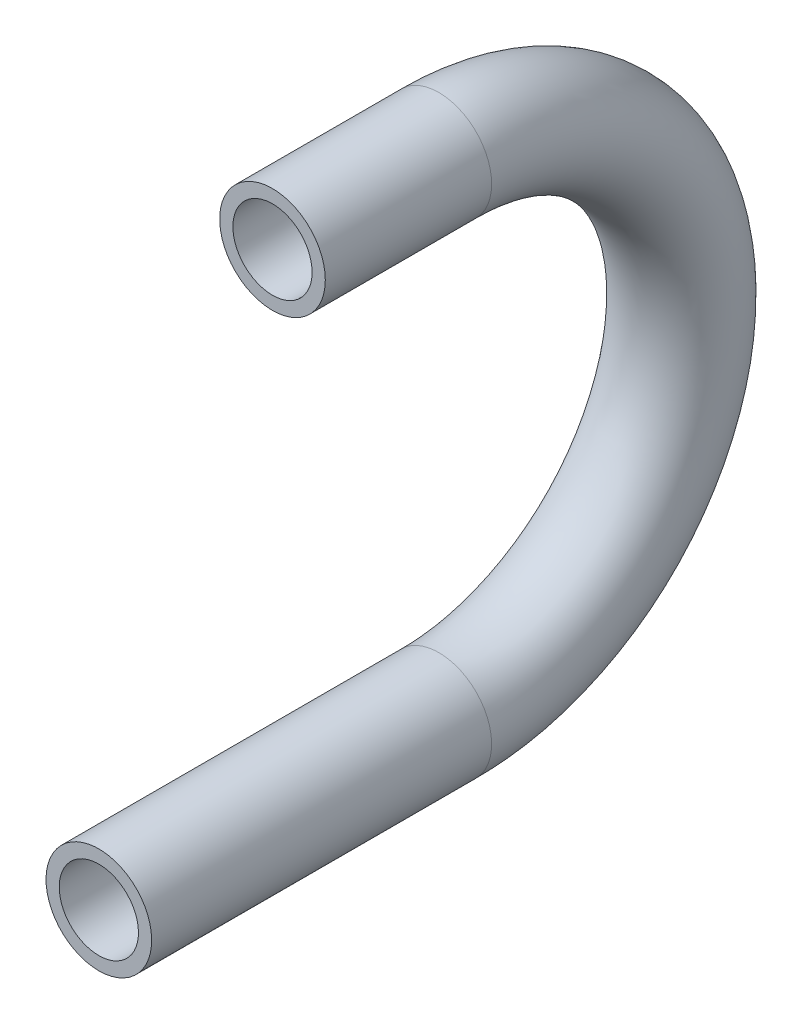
ISO-10303-21;
HEADER;
FILE_DESCRIPTION(('STEP AP214'),'2;1');
FILE_NAME('part.step','',(''),(''),'','','');
FILE_SCHEMA(('AUTOMOTIVE_DESIGN { 1 0 10303 214 1 1 1 1 }'));
ENDSEC;
DATA;
#1=APPLICATION_CONTEXT('core data for automotive mechanical design processes');
#2=APPLICATION_PROTOCOL_DEFINITION('international standard','automotive_design',2000,#1);
#3=PRODUCT_CONTEXT('',#1,'mechanical');
#4=PRODUCT('Part','Part','',(#3));
#5=PRODUCT_RELATED_PRODUCT_CATEGORY('part','',(#4));
#6=PRODUCT_DEFINITION_FORMATION('','',#4);
#7=PRODUCT_DEFINITION_CONTEXT('part definition',#1,'design');
#8=PRODUCT_DEFINITION('design','',#6,#7);
#9=PRODUCT_DEFINITION_SHAPE('','',#8);
#10=(LENGTH_UNIT() NAMED_UNIT(*) SI_UNIT(.MILLI.,.METRE.));
#11=(NAMED_UNIT(*) PLANE_ANGLE_UNIT() SI_UNIT($,.RADIAN.));
#12=(NAMED_UNIT(*) SI_UNIT($,.STERADIAN.) SOLID_ANGLE_UNIT());
#13=UNCERTAINTY_MEASURE_WITH_UNIT(LENGTH_MEASURE(1.E-05),#10,'distance_accuracy_value','');
#14=(GEOMETRIC_REPRESENTATION_CONTEXT(3) GLOBAL_UNCERTAINTY_ASSIGNED_CONTEXT((#13)) GLOBAL_UNIT_ASSIGNED_CONTEXT((#10,
#11,#12)) REPRESENTATION_CONTEXT('',''));
#15=CARTESIAN_POINT('',(0.,0.,0.));
#16=DIRECTION('',(0.,0.,1.));
#17=DIRECTION('',(1.,0.,0.));
#18=AXIS2_PLACEMENT_3D('',#15,#16,#17);
#19=CARTESIAN_POINT('',(0.,-29.16035176,-20.));
#20=DIRECTION('',(-1.,0.,0.));
#21=DIRECTION('',(0.,0.,1.));
#22=AXIS2_PLACEMENT_3D('',#19,#20,#21);
#23=TOROIDAL_SURFACE('',#22,29.16035176,4.7625);
#24=CARTESIAN_POINT('',(0.,0.,-20.));
#25=DIRECTION('',(0.,0.,1.));
#26=DIRECTION('',(1.,0.,0.));
#27=AXIS2_PLACEMENT_3D('',#24,#25,#26);
#28=CIRCLE('',#27,4.7625);
#29=CARTESIAN_POINT('',(4.7625,0.,-20.));
#30=VERTEX_POINT('',#29);
#31=EDGE_CURVE('E36',#30,#30,#28,.T.);
#32=ORIENTED_EDGE('',*,*,#31,.T.);
#33=EDGE_LOOP('',(#32));
#34=FACE_BOUND('',#33,.T.);
#35=CARTESIAN_POINT('',(0.,-58.32070352,-19.9999999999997));
#36=DIRECTION('',(0.,0.,1.));
#37=DIRECTION('',(0.,-1.,0.));
#38=AXIS2_PLACEMENT_3D('',#35,#36,#37);
#39=CIRCLE('',#38,4.7625);
#40=CARTESIAN_POINT('',(0.,-63.08320352,-19.9999999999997));
#41=VERTEX_POINT('',#40);
#42=EDGE_CURVE('E33',#41,#41,#39,.T.);
#43=ORIENTED_EDGE('',*,*,#42,.T.);
#44=EDGE_LOOP('',(#43));
#45=FACE_BOUND('',#44,.T.);
#46=ADVANCED_FACE('F14',(#34,#45),#23,.F.);
#47=CARTESIAN_POINT('',(0.,0.,-20.));
#48=DIRECTION('',(0.,0.,1.));
#49=DIRECTION('',(1.,0.,0.));
#50=AXIS2_PLACEMENT_3D('',#47,#48,#49);
#51=CYLINDRICAL_SURFACE('',#50,4.7625);
#52=CARTESIAN_POINT('',(0.,0.,0.));
#53=DIRECTION('',(0.,0.,1.));
#54=DIRECTION('',(1.,0.,0.));
#55=AXIS2_PLACEMENT_3D('',#52,#53,#54);
#56=CIRCLE('',#55,4.7625);
#57=CARTESIAN_POINT('',(4.7625,0.,0.));
#58=VERTEX_POINT('',#57);
#59=EDGE_CURVE('E18',#58,#58,#56,.F.);
#60=ORIENTED_EDGE('',*,*,#59,.F.);
#61=EDGE_LOOP('',(#60));
#62=FACE_BOUND('',#61,.T.);
#63=ORIENTED_EDGE('',*,*,#31,.F.);
#64=EDGE_LOOP('',(#63));
#65=FACE_BOUND('',#64,.T.);
#66=ADVANCED_FACE('F52',(#62,#65),#51,.F.);
#67=CARTESIAN_POINT('',(0.,-58.32070352,-19.9999999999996));
#68=DIRECTION('',(0.,0.,1.));
#69=DIRECTION('',(0.,-1.,0.));
#70=AXIS2_PLACEMENT_3D('',#67,#68,#69);
#71=CYLINDRICAL_SURFACE('',#70,4.7625);
#72=CARTESIAN_POINT('',(0.,-58.32070352,20.8775500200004));
#73=DIRECTION('',(0.,0.,1.));
#74=DIRECTION('',(0.,-1.,0.));
#75=AXIS2_PLACEMENT_3D('',#72,#73,#74);
#76=CIRCLE('',#75,4.7625);
#77=CARTESIAN_POINT('',(0.,-63.08320352,20.8775500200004));
#78=VERTEX_POINT('',#77);
#79=EDGE_CURVE('E43',#78,#78,#76,.T.);
#80=ORIENTED_EDGE('',*,*,#79,.T.);
#81=EDGE_LOOP('',(#80));
#82=FACE_BOUND('',#81,.T.);
#83=ORIENTED_EDGE('',*,*,#42,.F.);
#84=EDGE_LOOP('',(#83));
#85=FACE_BOUND('',#84,.T.);
#86=ADVANCED_FACE('F55',(#82,#85),#71,.F.);
#87=CARTESIAN_POINT('',(0.,0.,0.));
#88=DIRECTION('',(0.,0.,1.));
#89=DIRECTION('',(0.,-1.,0.));
#90=AXIS2_PLACEMENT_3D('',#87,#88,#89);
#91=PLANE('',#90);
#92=CARTESIAN_POINT('',(0.,0.,0.));
#93=DIRECTION('',(0.,0.,1.));
#94=DIRECTION('',(1.,0.,0.));
#95=AXIS2_PLACEMENT_3D('',#92,#93,#94);
#96=CIRCLE('',#95,6.35);
#97=CARTESIAN_POINT('',(6.35,0.,0.));
#98=VERTEX_POINT('',#97);
#99=EDGE_CURVE('E41',#98,#98,#96,.F.);
#100=ORIENTED_EDGE('',*,*,#99,.F.);
#101=EDGE_LOOP('',(#100));
#102=FACE_BOUND('',#101,.T.);
#103=ORIENTED_EDGE('',*,*,#59,.T.);
#104=EDGE_LOOP('',(#103));
#105=FACE_BOUND('',#104,.T.);
#106=ADVANCED_FACE('F50',(#102,#105),#91,.T.);
#107=CARTESIAN_POINT('',(0.,-58.32070352,20.8775500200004));
#108=DIRECTION('',(0.,0.,-1.));
#109=DIRECTION('',(0.,1.,0.));
#110=AXIS2_PLACEMENT_3D('',#107,#108,#109);
#111=PLANE('',#110);
#112=CARTESIAN_POINT('',(0.,-58.32070352,20.8775500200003));
#113=DIRECTION('',(0.,0.,1.));
#114=DIRECTION('',(0.,-1.,0.));
#115=AXIS2_PLACEMENT_3D('',#112,#113,#114);
#116=CIRCLE('',#115,6.35);
#117=CARTESIAN_POINT('',(0.,-64.67070352,20.8775500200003));
#118=VERTEX_POINT('',#117);
#119=EDGE_CURVE('E27',#118,#118,#116,.F.);
#120=ORIENTED_EDGE('',*,*,#119,.F.);
#121=EDGE_LOOP('',(#120));
#122=FACE_BOUND('',#121,.T.);
#123=ORIENTED_EDGE('',*,*,#79,.F.);
#124=EDGE_LOOP('',(#123));
#125=FACE_BOUND('',#124,.T.);
#126=ADVANCED_FACE('F68',(#122,#125),#111,.F.);
#127=CARTESIAN_POINT('',(0.,0.,-20.));
#128=DIRECTION('',(0.,0.,1.));
#129=DIRECTION('',(1.,0.,0.));
#130=AXIS2_PLACEMENT_3D('',#127,#128,#129);
#131=CYLINDRICAL_SURFACE('',#130,6.35);
#132=ORIENTED_EDGE('',*,*,#99,.T.);
#133=EDGE_LOOP('',(#132));
#134=FACE_BOUND('',#133,.T.);
#135=CARTESIAN_POINT('',(0.,0.,-20.));
#136=DIRECTION('',(0.,0.,-1.));
#137=DIRECTION('',(0.,1.,0.));
#138=AXIS2_PLACEMENT_3D('',#135,#136,#137);
#139=CIRCLE('',#138,6.35);
#140=CARTESIAN_POINT('',(0.,6.35,-20.));
#141=VERTEX_POINT('',#140);
#142=EDGE_CURVE('E22',#141,#141,#139,.T.);
#143=ORIENTED_EDGE('',*,*,#142,.F.);
#144=EDGE_LOOP('',(#143));
#145=FACE_BOUND('',#144,.T.);
#146=ADVANCED_FACE('F79',(#134,#145),#131,.T.);
#147=CARTESIAN_POINT('',(0.,-58.32070352,-19.9999999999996));
#148=DIRECTION('',(0.,0.,1.));
#149=DIRECTION('',(0.,-1.,0.));
#150=AXIS2_PLACEMENT_3D('',#147,#148,#149);
#151=CYLINDRICAL_SURFACE('',#150,6.35);
#152=ORIENTED_EDGE('',*,*,#119,.T.);
#153=EDGE_LOOP('',(#152));
#154=FACE_BOUND('',#153,.T.);
#155=CARTESIAN_POINT('',(0.,-58.32070352,-19.9999999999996));
#156=DIRECTION('',(0.,0.,1.));
#157=DIRECTION('',(0.,-1.,0.));
#158=AXIS2_PLACEMENT_3D('',#155,#156,#157);
#159=CIRCLE('',#158,6.35);
#160=CARTESIAN_POINT('',(0.,-64.67070352,-19.9999999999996));
#161=VERTEX_POINT('',#160);
#162=EDGE_CURVE('E9',#161,#161,#159,.F.);
#163=ORIENTED_EDGE('',*,*,#162,.F.);
#164=EDGE_LOOP('',(#163));
#165=FACE_BOUND('',#164,.T.);
#166=ADVANCED_FACE('F73',(#154,#165),#151,.T.);
#167=CARTESIAN_POINT('',(0.,-29.16035176,-20.));
#168=DIRECTION('',(-1.,0.,0.));
#169=DIRECTION('',(0.,0.,1.));
#170=AXIS2_PLACEMENT_3D('',#167,#168,#169);
#171=TOROIDAL_SURFACE('',#170,29.16035176,6.35);
#172=ORIENTED_EDGE('',*,*,#142,.T.);
#173=EDGE_LOOP('',(#172));
#174=FACE_BOUND('',#173,.T.);
#175=ORIENTED_EDGE('',*,*,#162,.T.);
#176=EDGE_LOOP('',(#175));
#177=FACE_BOUND('',#176,.T.);
#178=ADVANCED_FACE('F71',(#174,#177),#171,.T.);
#179=CLOSED_SHELL('',(#46,#66,#86,#106,#126,#146,#166,#178));
#180=MANIFOLD_SOLID_BREP('B1',#179);
#181=ADVANCED_BREP_SHAPE_REPRESENTATION('',(#18,#180),#14);
#182=SHAPE_DEFINITION_REPRESENTATION(#9,#181);
ENDSEC;
END-ISO-10303-21;
